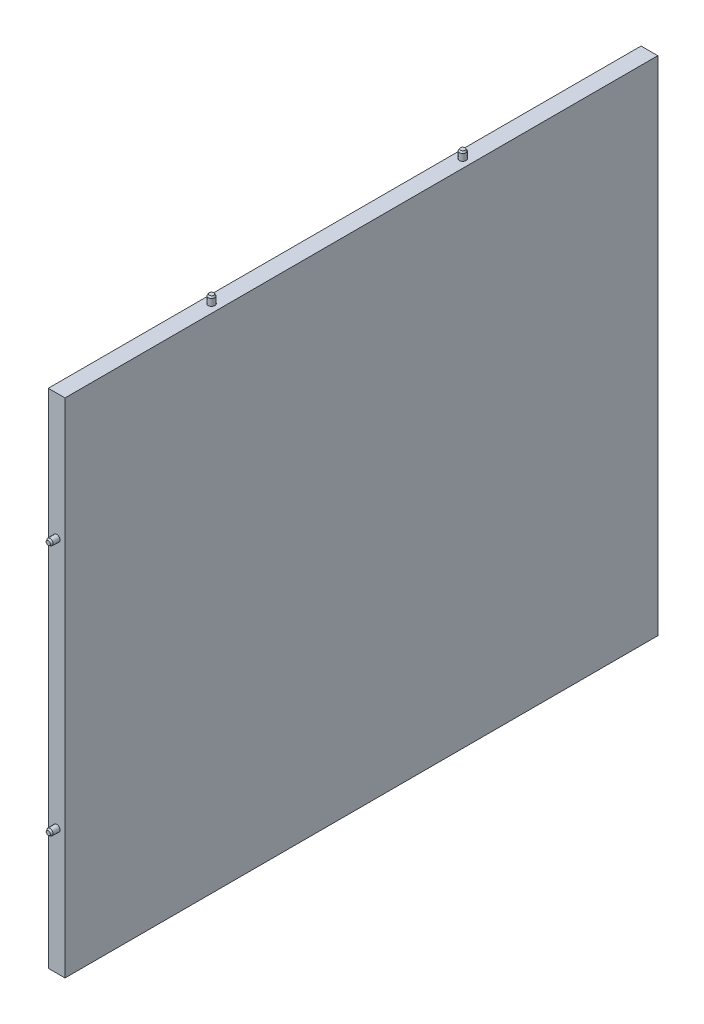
from build123d import *
from OCP.BRepFilletAPI import BRepFilletAPI_MakeChamfer

# Parameters (mm, degrees)
SKETCH1_W                     = 325
SKETCH1_H                     = 300
BOSS_EXTRUDE1_DEPTH           = 10
SKETCH2_R                     = 2
BOSS_EXTRUDE2_DEPTH           = 5
BOSS_EXTRUDE2_DRAFT           = 2
BOSS_EXTRUDE2_PROFILE_2_DEPTH = 5
BOSS_EXTRUDE2_PROFILE_2_DRAFT = 2
SKETCH3_R                     = 2
BOSS_EXTRUDE3_DEPTH           = 5
BOSS_EXTRUDE3_DRAFT           = 1
BOSS_EXTRUDE3_PROFILE_2_DEPTH = 5
BOSS_EXTRUDE3_PROFILE_2_DRAFT = 1
SKETCH4_R                     = 2
CUT_EXTRUDE1_DEPTH            = 5
CHAMFER2_SIZE                 = 1
CHAMFER2_SIZE2                = 0.589589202
CHAMFER2_SIZE2_2              = 0.583316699
SKETCH5_W                     = 29
SKETCH5_H                     = 300
BOSS_EXTRUDE4_DEPTH           = 10


with BuildPart() as part:
    # Sketch1 → Boss-Extrude1 (new body)
    with BuildSketch(Plane(origin=(0, 0, 0), x_dir=(0, 0, -1), z_dir=(1, 0, 0))):
        Rectangle(SKETCH1_W, SKETCH1_H)
    extrude(amount=BOSS_EXTRUDE1_DEPTH)


with BuildPart() as boss_extrude2_tool:
    # Sketch2 → Boss-Extrude2 (with draft: the straight prism first)
    with BuildSketch(Plane.XY.offset(162.5)):
        with Locations((5, 75)):
            Circle(SKETCH2_R)
    extrude(amount=BOSS_EXTRUDE2_DEPTH)
    # Boss-Extrude2: the draft: its side faces are tilted about the plane it starts from
    boss_extrude2_sides = [boss_extrude2_tool.faces().sort_by_distance(p)[0] for p in [
        (3, 75, 165),
    ]]
    draft(boss_extrude2_sides, Plane.XY.offset(162.5), BOSS_EXTRUDE2_DRAFT)


with BuildPart() as part_1:
    add(part.part)

    # Boss-Extrude2: add boss_extrude2_tool
    add(boss_extrude2_tool.part)


with BuildPart() as boss_extrude2_profile_2_tool:
    # Sketch2 → Boss-Extrude2 profile 2 (with draft: the straight prism first)
    with BuildSketch(Plane.XY.offset(162.5)):
        with Locations((5, -75)):
            Circle(SKETCH2_R)
    extrude(amount=BOSS_EXTRUDE2_PROFILE_2_DEPTH)
    # Boss-Extrude2 profile 2: the draft: its side faces are tilted about the plane it starts from
    boss_extrude2_profile_2_sides = [boss_extrude2_profile_2_tool.faces().sort_by_distance(p)[0] for p in [
        (3, -75, 165),
    ]]
    draft(boss_extrude2_profile_2_sides, Plane.XY.offset(162.5), BOSS_EXTRUDE2_PROFILE_2_DRAFT)


with BuildPart() as part_2:
    add(part_1.part)

    # Boss-Extrude2 profile 2: add boss_extrude2_profile_2_tool
    add(boss_extrude2_profile_2_tool.part)


with BuildPart() as boss_extrude3_tool:
    # Sketch3 → Boss-Extrude3 (with draft: the straight prism first)
    with BuildSketch(Plane(origin=(0, 150, 0), x_dir=(1, 0, 0), z_dir=(0, 1, 0))):
        with Locations((5, -70)):
            Circle(SKETCH3_R)
    extrude(amount=BOSS_EXTRUDE3_DEPTH)
    # Boss-Extrude3: the draft: its side faces are tilted about the plane it starts from
    boss_extrude3_sides = [boss_extrude3_tool.faces().sort_by_distance(p)[0] for p in [
        (3, 152.5, 70),
    ]]
    draft(boss_extrude3_sides, Plane(origin=(0, 150, 0), x_dir=(1, 0, 0), z_dir=(0, 1, 0)), BOSS_EXTRUDE3_DRAFT)


with BuildPart() as part_3:
    add(part_2.part)

    # Boss-Extrude3: add boss_extrude3_tool
    add(boss_extrude3_tool.part)


with BuildPart() as boss_extrude3_profile_2_tool:
    # Sketch3 → Boss-Extrude3 profile 2 (with draft: the straight prism first)
    with BuildSketch(Plane(origin=(0, 150, 0), x_dir=(1, 0, 0), z_dir=(0, 1, 0))):
        with Locations((5, 80)):
            Circle(SKETCH3_R)
    extrude(amount=BOSS_EXTRUDE3_PROFILE_2_DEPTH)
    # Boss-Extrude3 profile 2: the draft: its side faces are tilted about the plane it starts from
    boss_extrude3_profile_2_sides = [boss_extrude3_profile_2_tool.faces().sort_by_distance(p)[0] for p in [
        (3, 152.5, -80),
    ]]
    draft(boss_extrude3_profile_2_sides, Plane(origin=(0, 150, 0), x_dir=(1, 0, 0), z_dir=(0, 1, 0)), BOSS_EXTRUDE3_PROFILE_2_DRAFT)


with BuildPart() as part_4:
    add(part_3.part)

    # Boss-Extrude3 profile 2: add boss_extrude3_profile_2_tool
    add(boss_extrude3_profile_2_tool.part)

    # Sketch4 → Cut-Extrude1 (cut)
    with BuildSketch(Plane.ZY):
        with Locations((-100, -75)):
            Circle(SKETCH4_R)
        with Locations(Location((100, -75, 0), (0, 0, 180))):
            Circle(SKETCH4_R)
        with Locations((100, 75)):
            Circle(SKETCH4_R)
        with Locations(Location((-100, 75, 0), (0, 0, 180))):
            Circle(SKETCH4_R)
    extrude(amount=-CUT_EXTRUDE1_DEPTH, mode=Mode.SUBTRACT)

    # Chamfer2: one chamfer whose edges measure the first distance from different faces: ONE call of the kernel's chamfer builder (chamfer() names one face for all edges)
    chamfer2_edges_1 = [part_4.edges().sort_by_distance(p)[0] for p in [
        (3.174603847, 75, 167.5),
    ]]
    chamfer2_side_1 = [part_4.faces().sort_by_distance(p)[0] for p in [
        (3.087301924, 75, 165),
    ]]
    chamfer2_edges_2 = [part_4.edges().sort_by_distance(p)[0] for p in [
        (3.174603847, -75, 167.5),
    ]]
    chamfer2_side_2 = [part_4.faces().sort_by_distance(p)[0] for p in [
        (3.087301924, -75, 165),
    ]]
    chamfer2_edges_3 = [part_4.edges().sort_by_distance(p)[0] for p in [
        (3.087275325, 155, 70),
    ]]
    chamfer2_side_3 = [part_4.faces().sort_by_distance(p)[0] for p in [
        (3.043637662, 152.5, 70),
    ]]
    chamfer2_edges_4 = [part_4.edges().sort_by_distance(p)[0] for p in [
        (3.087275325, 155, -80),
    ]]
    chamfer2_side_4 = [part_4.faces().sort_by_distance(p)[0] for p in [
        (3.043637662, 152.5, -80),
    ]]
    chamfer2 = BRepFilletAPI_MakeChamfer(part_4.part.solid().wrapped)
    for e in chamfer2_edges_1:
        chamfer2.Add(CHAMFER2_SIZE, CHAMFER2_SIZE2, e.wrapped, chamfer2_side_1[0].wrapped)  # the first distance lies on this face
    for e in chamfer2_edges_2:
        chamfer2.Add(CHAMFER2_SIZE, CHAMFER2_SIZE2, e.wrapped, chamfer2_side_2[0].wrapped)  # the first distance lies on this face
    for e in chamfer2_edges_3:
        chamfer2.Add(CHAMFER2_SIZE, CHAMFER2_SIZE2_2, e.wrapped, chamfer2_side_3[0].wrapped)  # the first distance lies on this face
    for e in chamfer2_edges_4:
        chamfer2.Add(CHAMFER2_SIZE, CHAMFER2_SIZE2_2, e.wrapped, chamfer2_side_4[0].wrapped)  # the first distance lies on this face
    add(Compound.cast(chamfer2.Shape()), mode=Mode.REPLACE)

    # Sketch5 → Boss-Extrude4 (add)
    with BuildSketch(Plane.ZY):
        with Locations((-177, 0)):
            Rectangle(SKETCH5_W, SKETCH5_H)
    extrude(amount=-BOSS_EXTRUDE4_DEPTH)


solid = part_4.part
